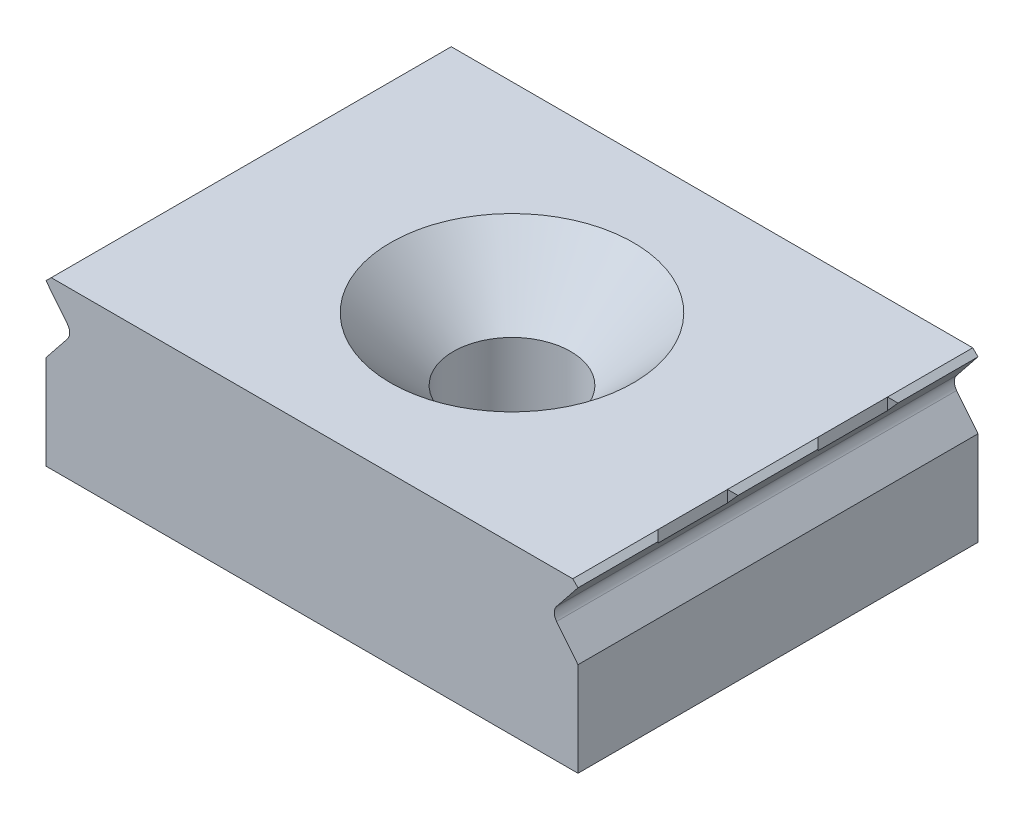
ISO-10303-21;
HEADER;
FILE_DESCRIPTION(('STEP AP214'),'2;1');
FILE_NAME('part.step','',(''),(''),'','','');
FILE_SCHEMA(('AUTOMOTIVE_DESIGN { 1 0 10303 214 1 1 1 1 }'));
ENDSEC;
DATA;
#1=APPLICATION_CONTEXT('core data for automotive mechanical design processes');
#2=APPLICATION_PROTOCOL_DEFINITION('international standard','automotive_design',2000,#1);
#3=PRODUCT_CONTEXT('',#1,'mechanical');
#4=PRODUCT('Part','Part','',(#3));
#5=PRODUCT_RELATED_PRODUCT_CATEGORY('part','',(#4));
#6=PRODUCT_DEFINITION_FORMATION('','',#4);
#7=PRODUCT_DEFINITION_CONTEXT('part definition',#1,'design');
#8=PRODUCT_DEFINITION('design','',#6,#7);
#9=PRODUCT_DEFINITION_SHAPE('','',#8);
#10=(LENGTH_UNIT() NAMED_UNIT(*) SI_UNIT(.MILLI.,.METRE.));
#11=(NAMED_UNIT(*) PLANE_ANGLE_UNIT() SI_UNIT($,.RADIAN.));
#12=(NAMED_UNIT(*) SI_UNIT($,.STERADIAN.) SOLID_ANGLE_UNIT());
#13=UNCERTAINTY_MEASURE_WITH_UNIT(LENGTH_MEASURE(1.E-05),#10,'distance_accuracy_value','');
#14=(GEOMETRIC_REPRESENTATION_CONTEXT(3) GLOBAL_UNCERTAINTY_ASSIGNED_CONTEXT((#13)) GLOBAL_UNIT_ASSIGNED_CONTEXT((#10,
#11,#12)) REPRESENTATION_CONTEXT('',''));
#15=CARTESIAN_POINT('',(0.,0.,0.));
#16=DIRECTION('',(0.,0.,1.));
#17=DIRECTION('',(1.,0.,0.));
#18=AXIS2_PLACEMENT_3D('',#15,#16,#17);
#19=CARTESIAN_POINT('',(12.45,3.96,0.));
#20=DIRECTION('',(0.707106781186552,0.707106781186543,0.));
#21=DIRECTION('',(0.,0.,1.));
#22=AXIS2_PLACEMENT_3D('',#19,#20,#21);
#23=PLANE('',#22);
#24=DIRECTION('',(0.577350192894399,-0.577350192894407,0.57735042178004));
#25=VECTOR('',#24,1.);
#26=CARTESIAN_POINT('',(13.1700001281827,3.23999987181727,-1.43999968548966));
#27=LINE('',#26,#25);
#28=CARTESIAN_POINT('',(12.45,3.96,-2.16000009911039));
#29=VERTEX_POINT('',#28);
#30=CARTESIAN_POINT('',(12.7,3.70999999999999,-1.91));
#31=VERTEX_POINT('',#30);
#32=EDGE_CURVE('E260',#29,#31,#27,.T.);
#33=ORIENTED_EDGE('',*,*,#32,.F.);
#34=DIRECTION('',(0.,0.,-1.));
#35=VECTOR('',#34,1.);
#36=CARTESIAN_POINT('',(12.45,3.96,-9.55));
#37=LINE('',#36,#35);
#38=CARTESIAN_POINT('',(12.45,3.96,2.15999990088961));
#39=VERTEX_POINT('',#38);
#40=EDGE_CURVE('E400',#39,#29,#37,.T.);
#41=ORIENTED_EDGE('',*,*,#40,.F.);
#42=DIRECTION('',(-0.577350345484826,0.577350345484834,0.577350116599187));
#43=VECTOR('',#42,1.);
#44=CARTESIAN_POINT('',(13.1699998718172,3.24000012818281,1.44000031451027));
#45=LINE('',#44,#43);
#46=CARTESIAN_POINT('',(12.7,3.70999999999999,1.91));
#47=VERTEX_POINT('',#46);
#48=EDGE_CURVE('E273',#47,#39,#45,.T.);
#49=ORIENTED_EDGE('',*,*,#48,.F.);
#50=DIRECTION('',(0.,0.,1.));
#51=VECTOR('',#50,1.);
#52=CARTESIAN_POINT('',(12.7,3.71,9.55));
#53=LINE('',#52,#51);
#54=EDGE_CURVE('E413',#31,#47,#53,.T.);
#55=ORIENTED_EDGE('',*,*,#54,.F.);
#56=EDGE_LOOP('',(#33,#41,#49,#55));
#57=FACE_BOUND('',#56,.T.);
#58=ADVANCED_FACE('F39',(#57),#23,.T.);
#59=CARTESIAN_POINT('',(-12.45,3.96,0.));
#60=DIRECTION('',(-0.707106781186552,0.707106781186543,0.));
#61=DIRECTION('',(0.,0.,-1.));
#62=AXIS2_PLACEMENT_3D('',#59,#60,#61);
#63=PLANE('',#62);
#64=DIRECTION('',(0.577350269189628,0.577350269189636,-0.577350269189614));
#65=VECTOR('',#64,1.);
#66=CARTESIAN_POINT('',(-13.17,3.24000000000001,-1.44000000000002));
#67=LINE('',#66,#65);
#68=CARTESIAN_POINT('',(-12.7,3.71000000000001,-1.91));
#69=VERTEX_POINT('',#68);
#70=CARTESIAN_POINT('',(-12.45,3.96,-2.15999999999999));
#71=VERTEX_POINT('',#70);
#72=EDGE_CURVE('E201',#69,#71,#67,.T.);
#73=ORIENTED_EDGE('',*,*,#72,.F.);
#74=DIRECTION('',(0.,0.,-1.));
#75=VECTOR('',#74,1.);
#76=CARTESIAN_POINT('',(-12.7,3.71,-9.55));
#77=LINE('',#76,#75);
#78=CARTESIAN_POINT('',(-12.7,3.71000000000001,1.91000000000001));
#79=VERTEX_POINT('',#78);
#80=EDGE_CURVE('E426',#79,#69,#77,.T.);
#81=ORIENTED_EDGE('',*,*,#80,.F.);
#82=DIRECTION('',(-0.57735026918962,-0.577350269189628,-0.577350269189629));
#83=VECTOR('',#82,1.);
#84=CARTESIAN_POINT('',(-13.17,3.23999999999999,1.44));
#85=LINE('',#84,#83);
#86=CARTESIAN_POINT('',(-12.45,3.96,2.16000000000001));
#87=VERTEX_POINT('',#86);
#88=EDGE_CURVE('E226',#87,#79,#85,.T.);
#89=ORIENTED_EDGE('',*,*,#88,.F.);
#90=DIRECTION('',(0.,0.,1.));
#91=VECTOR('',#90,1.);
#92=CARTESIAN_POINT('',(-12.45,3.96,9.55));
#93=LINE('',#92,#91);
#94=EDGE_CURVE('E224',#71,#87,#93,.T.);
#95=ORIENTED_EDGE('',*,*,#94,.F.);
#96=EDGE_LOOP('',(#73,#81,#89,#95));
#97=FACE_BOUND('',#96,.T.);
#98=ADVANCED_FACE('F225',(#97),#63,.T.);
#99=DIRECTION('',(0.577350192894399,-0.577350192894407,0.57735042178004));
#100=VECTOR('',#99,1.);
#101=CARTESIAN_POINT('',(10.6233331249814,5.78666687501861,3.65333230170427));
#102=LINE('',#101,#100);
#103=CARTESIAN_POINT('',(12.45,3.96,5.47999990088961));
#104=VERTEX_POINT('',#103);
#105=CARTESIAN_POINT('',(12.7,3.70999999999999,5.73));
#106=VERTEX_POINT('',#105);
#107=EDGE_CURVE('E288',#104,#106,#102,.T.);
#108=ORIENTED_EDGE('',*,*,#107,.F.);
#109=CARTESIAN_POINT('',(12.45,3.96,9.55));
#110=VERTEX_POINT('',#109);
#111=EDGE_CURVE('E395',#110,#104,#37,.T.);
#112=ORIENTED_EDGE('',*,*,#111,.F.);
#113=DIRECTION('',(-0.707106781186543,0.707106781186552,0.));
#114=VECTOR('',#113,1.);
#115=CARTESIAN_POINT('',(12.45,3.96,9.55));
#116=LINE('',#115,#114);
#117=CARTESIAN_POINT('',(12.7,3.71,9.55));
#118=VERTEX_POINT('',#117);
#119=EDGE_CURVE('E417',#118,#110,#116,.T.);
#120=ORIENTED_EDGE('',*,*,#119,.F.);
#121=EDGE_CURVE('E407',#106,#118,#53,.T.);
#122=ORIENTED_EDGE('',*,*,#121,.F.);
#123=EDGE_LOOP('',(#108,#112,#120,#122));
#124=FACE_BOUND('',#123,.T.);
#125=ADVANCED_FACE('F482',(#124),#23,.T.);
#126=DIRECTION('',(0.577350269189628,0.577350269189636,-0.577350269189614));
#127=VECTOR('',#126,1.);
#128=CARTESIAN_POINT('',(-10.6233333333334,5.78666666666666,3.65333333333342));
#129=LINE('',#128,#127);
#130=CARTESIAN_POINT('',(-12.7,3.71000000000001,5.73));
#131=VERTEX_POINT('',#130);
#132=CARTESIAN_POINT('',(-12.45,3.96,5.48000000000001));
#133=VERTEX_POINT('',#132);
#134=EDGE_CURVE('E293',#131,#133,#129,.T.);
#135=ORIENTED_EDGE('',*,*,#134,.F.);
#136=CARTESIAN_POINT('',(-12.7,3.71,9.55));
#137=VERTEX_POINT('',#136);
#138=EDGE_CURVE('E421',#137,#131,#77,.T.);
#139=ORIENTED_EDGE('',*,*,#138,.F.);
#140=DIRECTION('',(-0.707106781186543,-0.707106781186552,0.));
#141=VECTOR('',#140,1.);
#142=CARTESIAN_POINT('',(-12.45,3.96,9.55));
#143=LINE('',#142,#141);
#144=CARTESIAN_POINT('',(-12.45,3.96,9.55));
#145=VERTEX_POINT('',#144);
#146=EDGE_CURVE('E412',#145,#137,#143,.T.);
#147=ORIENTED_EDGE('',*,*,#146,.F.);
#148=EDGE_CURVE('E232',#133,#145,#93,.T.);
#149=ORIENTED_EDGE('',*,*,#148,.F.);
#150=EDGE_LOOP('',(#135,#139,#147,#149));
#151=FACE_BOUND('',#150,.T.);
#152=ADVANCED_FACE('F487',(#151),#63,.T.);
#153=CARTESIAN_POINT('',(12.7,3.96,9.55));
#154=DIRECTION('',(0.,0.,-1.));
#155=DIRECTION('',(-1.,0.,0.));
#156=AXIS2_PLACEMENT_3D('',#153,#154,#155);
#157=PLANE('',#156);
#158=DIRECTION('',(-0.624095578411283,0.781348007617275,0.));
#159=VECTOR('',#158,1.);
#160=CARTESIAN_POINT('',(11.6792457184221,1.80795221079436,9.55));
#161=LINE('',#160,#159);
#162=CARTESIAN_POINT('',(12.7,0.530000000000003,9.55));
#163=VERTEX_POINT('',#162);
#164=CARTESIAN_POINT('',(11.6792457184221,1.80795221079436,9.55));
#165=VERTEX_POINT('',#164);
#166=EDGE_CURVE('E314',#163,#165,#161,.T.);
#167=ORIENTED_EDGE('',*,*,#166,.T.);
#168=CARTESIAN_POINT('',(12.0699197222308,2.12,9.55));
#169=DIRECTION('',(0.,0.,-1.));
#170=DIRECTION('',(1.,0.,0.));
#171=AXIS2_PLACEMENT_3D('',#168,#169,#170);
#172=CIRCLE('',#171,0.5);
#173=CARTESIAN_POINT('',(11.6792457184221,2.43204778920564,9.55));
#174=VERTEX_POINT('',#173);
#175=EDGE_CURVE('E310',#165,#174,#172,.T.);
#176=ORIENTED_EDGE('',*,*,#175,.T.);
#177=DIRECTION('',(0.624095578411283,0.781348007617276,0.));
#178=VECTOR('',#177,1.);
#179=CARTESIAN_POINT('',(12.7,3.71,9.55));
#180=LINE('',#179,#178);
#181=EDGE_CURVE('E296',#174,#118,#180,.T.);
#182=ORIENTED_EDGE('',*,*,#181,.T.);
#183=ORIENTED_EDGE('',*,*,#119,.T.);
#184=DIRECTION('',(1.,0.,0.));
#185=VECTOR('',#184,1.);
#186=CARTESIAN_POINT('',(12.7,3.96,9.55));
#187=LINE('',#186,#185);
#188=EDGE_CURVE('E360',#145,#110,#187,.T.);
#189=ORIENTED_EDGE('',*,*,#188,.F.);
#190=ORIENTED_EDGE('',*,*,#146,.T.);
#191=DIRECTION('',(-0.624095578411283,0.781348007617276,0.));
#192=VECTOR('',#191,1.);
#193=CARTESIAN_POINT('',(-12.7,3.71,9.55));
#194=LINE('',#193,#192);
#195=CARTESIAN_POINT('',(-11.6792457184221,2.43204778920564,9.55));
#196=VERTEX_POINT('',#195);
#197=EDGE_CURVE('E306',#196,#137,#194,.T.);
#198=ORIENTED_EDGE('',*,*,#197,.F.);
#199=CARTESIAN_POINT('',(-12.0699197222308,2.12,9.55));
#200=DIRECTION('',(0.,0.,1.));
#201=DIRECTION('',(-1.,0.,0.));
#202=AXIS2_PLACEMENT_3D('',#199,#200,#201);
#203=CIRCLE('',#202,0.5);
#204=CARTESIAN_POINT('',(-11.6792457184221,1.80795221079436,9.55));
#205=VERTEX_POINT('',#204);
#206=EDGE_CURVE('E348',#205,#196,#203,.T.);
#207=ORIENTED_EDGE('',*,*,#206,.F.);
#208=DIRECTION('',(0.624095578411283,0.781348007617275,0.));
#209=VECTOR('',#208,1.);
#210=CARTESIAN_POINT('',(-11.6792457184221,1.80795221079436,9.55));
#211=LINE('',#210,#209);
#212=CARTESIAN_POINT('',(-12.7,0.530000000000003,9.55));
#213=VERTEX_POINT('',#212);
#214=EDGE_CURVE('E344',#213,#205,#211,.T.);
#215=ORIENTED_EDGE('',*,*,#214,.F.);
#216=DIRECTION('',(0.,-1.,0.));
#217=VECTOR('',#216,1.);
#218=CARTESIAN_POINT('',(-12.7,3.96,9.55));
#219=LINE('',#218,#217);
#220=CARTESIAN_POINT('',(-12.7,-3.96,9.55));
#221=VERTEX_POINT('',#220);
#222=EDGE_CURVE('E390',#213,#221,#219,.T.);
#223=ORIENTED_EDGE('',*,*,#222,.T.);
#224=DIRECTION('',(1.,0.,0.));
#225=VECTOR('',#224,1.);
#226=CARTESIAN_POINT('',(12.7,-3.96,9.55));
#227=LINE('',#226,#225);
#228=CARTESIAN_POINT('',(12.7,-3.96,9.55));
#229=VERTEX_POINT('',#228);
#230=EDGE_CURVE('E371',#221,#229,#227,.T.);
#231=ORIENTED_EDGE('',*,*,#230,.T.);
#232=DIRECTION('',(0.,-1.,0.));
#233=VECTOR('',#232,1.);
#234=CARTESIAN_POINT('',(12.7,3.96,9.55));
#235=LINE('',#234,#233);
#236=EDGE_CURVE('E387',#163,#229,#235,.T.);
#237=ORIENTED_EDGE('',*,*,#236,.F.);
#238=EDGE_LOOP('',(#167,#176,#182,#183,#189,#190,#198,#207,#215,#223,#231,#237));
#239=FACE_BOUND('',#238,.T.);
#240=ADVANCED_FACE('F548',(#239),#157,.F.);
#241=CARTESIAN_POINT('',(12.7,3.96,9.55));
#242=DIRECTION('',(-1.,0.,0.));
#243=DIRECTION('',(0.,0.,1.));
#244=AXIS2_PLACEMENT_3D('',#241,#242,#243);
#245=PLANE('',#244);
#246=DIRECTION('',(0.,0.,1.));
#247=VECTOR('',#246,1.);
#248=CARTESIAN_POINT('',(12.7,0.530000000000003,-12.9248305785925));
#249=LINE('',#248,#247);
#250=CARTESIAN_POINT('',(12.7,0.530000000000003,-9.55));
#251=VERTEX_POINT('',#250);
#252=EDGE_CURVE('E319',#251,#163,#249,.T.);
#253=ORIENTED_EDGE('',*,*,#252,.T.);
#254=ORIENTED_EDGE('',*,*,#236,.T.);
#255=DIRECTION('',(0.,0.,-1.));
#256=VECTOR('',#255,1.);
#257=CARTESIAN_POINT('',(12.7,-3.96,9.55));
#258=LINE('',#257,#256);
#259=CARTESIAN_POINT('',(12.7,-3.96,-9.55));
#260=VERTEX_POINT('',#259);
#261=EDGE_CURVE('E375',#229,#260,#258,.T.);
#262=ORIENTED_EDGE('',*,*,#261,.T.);
#263=DIRECTION('',(0.,-1.,0.));
#264=VECTOR('',#263,1.);
#265=CARTESIAN_POINT('',(12.7,3.96,-9.55));
#266=LINE('',#265,#264);
#267=EDGE_CURVE('E384',#251,#260,#266,.T.);
#268=ORIENTED_EDGE('',*,*,#267,.F.);
#269=EDGE_LOOP('',(#253,#254,#262,#268));
#270=FACE_BOUND('',#269,.T.);
#271=ADVANCED_FACE('F545',(#270),#245,.F.);
#272=CARTESIAN_POINT('',(12.7,3.96,-9.55));
#273=DIRECTION('',(0.,0.,1.));
#274=DIRECTION('',(1.,0.,0.));
#275=AXIS2_PLACEMENT_3D('',#272,#273,#274);
#276=PLANE('',#275);
#277=DIRECTION('',(0.624095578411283,-0.781348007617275,0.));
#278=VECTOR('',#277,1.);
#279=CARTESIAN_POINT('',(11.6792457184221,1.80795221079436,-9.55));
#280=LINE('',#279,#278);
#281=CARTESIAN_POINT('',(11.6792457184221,1.80795221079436,-9.55));
#282=VERTEX_POINT('',#281);
#283=EDGE_CURVE('E297',#282,#251,#280,.T.);
#284=ORIENTED_EDGE('',*,*,#283,.T.);
#285=ORIENTED_EDGE('',*,*,#267,.T.);
#286=DIRECTION('',(-1.,0.,0.));
#287=VECTOR('',#286,1.);
#288=CARTESIAN_POINT('',(12.7,-3.96,-9.55));
#289=LINE('',#288,#287);
#290=CARTESIAN_POINT('',(-12.7,-3.96,-9.55));
#291=VERTEX_POINT('',#290);
#292=EDGE_CURVE('E364',#260,#291,#289,.T.);
#293=ORIENTED_EDGE('',*,*,#292,.T.);
#294=DIRECTION('',(0.,-1.,0.));
#295=VECTOR('',#294,1.);
#296=CARTESIAN_POINT('',(-12.7,3.96,-9.55));
#297=LINE('',#296,#295);
#298=CARTESIAN_POINT('',(-12.7,0.530000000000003,-9.55));
#299=VERTEX_POINT('',#298);
#300=EDGE_CURVE('E367',#299,#291,#297,.T.);
#301=ORIENTED_EDGE('',*,*,#300,.F.);
#302=DIRECTION('',(-0.624095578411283,-0.781348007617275,0.));
#303=VECTOR('',#302,1.);
#304=CARTESIAN_POINT('',(-11.6792457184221,1.80795221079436,-9.55));
#305=LINE('',#304,#303);
#306=CARTESIAN_POINT('',(-11.6792457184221,1.80795221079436,-9.55));
#307=VERTEX_POINT('',#306);
#308=EDGE_CURVE('E331',#307,#299,#305,.T.);
#309=ORIENTED_EDGE('',*,*,#308,.F.);
#310=CARTESIAN_POINT('',(-12.0699197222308,2.12,-9.55));
#311=DIRECTION('',(0.,0.,1.));
#312=DIRECTION('',(1.,0.,0.));
#313=AXIS2_PLACEMENT_3D('',#310,#311,#312);
#314=CIRCLE('',#313,0.5);
#315=CARTESIAN_POINT('',(-11.6792457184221,2.43204778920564,-9.55));
#316=VERTEX_POINT('',#315);
#317=EDGE_CURVE('E334',#316,#307,#314,.F.);
#318=ORIENTED_EDGE('',*,*,#317,.F.);
#319=DIRECTION('',(0.624095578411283,-0.781348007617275,0.));
#320=VECTOR('',#319,1.);
#321=CARTESIAN_POINT('',(-12.7,3.71,-9.55));
#322=LINE('',#321,#320);
#323=CARTESIAN_POINT('',(-12.7,3.71,-9.55));
#324=VERTEX_POINT('',#323);
#325=EDGE_CURVE('E338',#324,#316,#322,.T.);
#326=ORIENTED_EDGE('',*,*,#325,.F.);
#327=DIRECTION('',(0.707106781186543,0.707106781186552,0.));
#328=VECTOR('',#327,1.);
#329=CARTESIAN_POINT('',(-12.45,3.96,-9.55));
#330=LINE('',#329,#328);
#331=CARTESIAN_POINT('',(-12.45,3.96,-9.55));
#332=VERTEX_POINT('',#331);
#333=EDGE_CURVE('E399',#324,#332,#330,.T.);
#334=ORIENTED_EDGE('',*,*,#333,.T.);
#335=DIRECTION('',(-1.,0.,0.));
#336=VECTOR('',#335,1.);
#337=CARTESIAN_POINT('',(12.7,3.96,-9.55));
#338=LINE('',#337,#336);
#339=CARTESIAN_POINT('',(12.45,3.96,-9.55));
#340=VERTEX_POINT('',#339);
#341=EDGE_CURVE('E363',#340,#332,#338,.T.);
#342=ORIENTED_EDGE('',*,*,#341,.F.);
#343=DIRECTION('',(0.707106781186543,-0.707106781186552,0.));
#344=VECTOR('',#343,1.);
#345=CARTESIAN_POINT('',(12.45,3.96,-9.55));
#346=LINE('',#345,#344);
#347=CARTESIAN_POINT('',(12.7,3.71,-9.55));
#348=VERTEX_POINT('',#347);
#349=EDGE_CURVE('E403',#340,#348,#346,.T.);
#350=ORIENTED_EDGE('',*,*,#349,.T.);
#351=DIRECTION('',(-0.624095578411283,-0.781348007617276,0.));
#352=VECTOR('',#351,1.);
#353=CARTESIAN_POINT('',(12.7,3.71,-9.55));
#354=LINE('',#353,#352);
#355=CARTESIAN_POINT('',(11.6792457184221,2.43204778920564,-9.55));
#356=VERTEX_POINT('',#355);
#357=EDGE_CURVE('E301',#348,#356,#354,.T.);
#358=ORIENTED_EDGE('',*,*,#357,.T.);
#359=CARTESIAN_POINT('',(12.0699197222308,2.12,-9.55));
#360=DIRECTION('',(0.,0.,1.));
#361=DIRECTION('',(1.,0.,0.));
#362=AXIS2_PLACEMENT_3D('',#359,#360,#361);
#363=CIRCLE('',#362,0.5);
#364=EDGE_CURVE('E302',#356,#282,#363,.T.);
#365=ORIENTED_EDGE('',*,*,#364,.T.);
#366=EDGE_LOOP('',(#284,#285,#293,#301,#309,#318,#326,#334,#342,#350,#358,#365));
#367=FACE_BOUND('',#366,.T.);
#368=ADVANCED_FACE('F518',(#367),#276,.F.);
#369=CARTESIAN_POINT('',(-12.7,3.96,9.55));
#370=DIRECTION('',(1.,0.,0.));
#371=DIRECTION('',(0.,0.,-1.));
#372=AXIS2_PLACEMENT_3D('',#369,#370,#371);
#373=PLANE('',#372);
#374=ORIENTED_EDGE('',*,*,#222,.F.);
#375=DIRECTION('',(0.,0.,1.));
#376=VECTOR('',#375,1.);
#377=CARTESIAN_POINT('',(-12.7,0.530000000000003,-12.9248305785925));
#378=LINE('',#377,#376);
#379=EDGE_CURVE('E352',#299,#213,#378,.T.);
#380=ORIENTED_EDGE('',*,*,#379,.F.);
#381=ORIENTED_EDGE('',*,*,#300,.T.);
#382=DIRECTION('',(0.,0.,1.));
#383=VECTOR('',#382,1.);
#384=CARTESIAN_POINT('',(-12.7,-3.96,9.55));
#385=LINE('',#384,#383);
#386=EDGE_CURVE('E341',#291,#221,#385,.T.);
#387=ORIENTED_EDGE('',*,*,#386,.T.);
#388=EDGE_LOOP('',(#374,#380,#381,#387));
#389=FACE_BOUND('',#388,.T.);
#390=ADVANCED_FACE('F539',(#389),#373,.F.);
#391=CARTESIAN_POINT('',(0.,3.96,0.));
#392=DIRECTION('',(0.,1.,0.));
#393=DIRECTION('',(0.,0.,1.));
#394=AXIS2_PLACEMENT_3D('',#391,#392,#393);
#395=PLANE('',#394);
#396=CARTESIAN_POINT('',(0.,3.96,0.));
#397=DIRECTION('',(0.,1.,0.));
#398=DIRECTION('',(0.,0.,1.));
#399=AXIS2_PLACEMENT_3D('',#396,#397,#398);
#400=CIRCLE('',#399,5.80000000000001);
#401=CARTESIAN_POINT('',(0.,3.96,5.80000000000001));
#402=VERTEX_POINT('',#401);
#403=EDGE_CURVE('E11',#402,#402,#400,.F.);
#404=ORIENTED_EDGE('',*,*,#403,.T.);
#405=EDGE_LOOP('',(#404));
#406=FACE_BOUND('',#405,.T.);
#407=ORIENTED_EDGE('',*,*,#188,.T.);
#408=ORIENTED_EDGE('',*,*,#111,.T.);
#409=DIRECTION('',(0.,0.,1.));
#410=VECTOR('',#409,1.);
#411=CARTESIAN_POINT('',(12.45,3.96,5.47999990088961));
#412=LINE('',#411,#410);
#413=EDGE_CURVE('E212',#39,#104,#412,.T.);
#414=ORIENTED_EDGE('',*,*,#413,.F.);
#415=ORIENTED_EDGE('',*,*,#40,.T.);
#416=DIRECTION('',(0.,0.,1.));
#417=VECTOR('',#416,1.);
#418=CARTESIAN_POINT('',(12.45,3.96,-2.16000009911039));
#419=LINE('',#418,#417);
#420=CARTESIAN_POINT('',(12.45,3.96,-5.48000009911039));
#421=VERTEX_POINT('',#420);
#422=EDGE_CURVE('E252',#421,#29,#419,.T.);
#423=ORIENTED_EDGE('',*,*,#422,.F.);
#424=EDGE_CURVE('E394',#421,#340,#37,.T.);
#425=ORIENTED_EDGE('',*,*,#424,.T.);
#426=ORIENTED_EDGE('',*,*,#341,.T.);
#427=CARTESIAN_POINT('',(-12.45,3.96,-5.47999999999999));
#428=VERTEX_POINT('',#427);
#429=EDGE_CURVE('E231',#332,#428,#93,.T.);
#430=ORIENTED_EDGE('',*,*,#429,.T.);
#431=DIRECTION('',(0.,0.,-1.));
#432=VECTOR('',#431,1.);
#433=CARTESIAN_POINT('',(-12.45,3.96,-5.47999999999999));
#434=LINE('',#433,#432);
#435=EDGE_CURVE('E217',#71,#428,#434,.T.);
#436=ORIENTED_EDGE('',*,*,#435,.F.);
#437=ORIENTED_EDGE('',*,*,#94,.T.);
#438=DIRECTION('',(0.,0.,-1.));
#439=VECTOR('',#438,1.);
#440=CARTESIAN_POINT('',(-12.45,3.96,2.16000000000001));
#441=LINE('',#440,#439);
#442=EDGE_CURVE('E264',#133,#87,#441,.T.);
#443=ORIENTED_EDGE('',*,*,#442,.F.);
#444=ORIENTED_EDGE('',*,*,#148,.T.);
#445=EDGE_LOOP('',(#407,#408,#414,#415,#423,#425,#426,#430,#436,#437,#443,#444));
#446=FACE_BOUND('',#445,.T.);
#447=ADVANCED_FACE('F236',(#406,#446),#395,.T.);
#448=CARTESIAN_POINT('',(0.,-3.96,0.));
#449=DIRECTION('',(0.,1.,0.));
#450=DIRECTION('',(0.,0.,1.));
#451=AXIS2_PLACEMENT_3D('',#448,#449,#450);
#452=PLANE('',#451);
#453=CARTESIAN_POINT('',(0.,-3.96,0.));
#454=DIRECTION('',(0.,1.,0.));
#455=DIRECTION('',(0.,0.,1.));
#456=AXIS2_PLACEMENT_3D('',#453,#454,#455);
#457=CIRCLE('',#456,2.8);
#458=CARTESIAN_POINT('',(0.,-3.96,2.8));
#459=VERTEX_POINT('',#458);
#460=EDGE_CURVE('E248',#459,#459,#457,.F.);
#461=ORIENTED_EDGE('',*,*,#460,.F.);
#462=EDGE_LOOP('',(#461));
#463=FACE_BOUND('',#462,.T.);
#464=ORIENTED_EDGE('',*,*,#386,.F.);
#465=ORIENTED_EDGE('',*,*,#292,.F.);
#466=ORIENTED_EDGE('',*,*,#261,.F.);
#467=ORIENTED_EDGE('',*,*,#230,.F.);
#468=EDGE_LOOP('',(#464,#465,#466,#467));
#469=FACE_BOUND('',#468,.T.);
#470=ADVANCED_FACE('F494',(#463,#469),#452,.F.);
#471=DIRECTION('',(-0.577350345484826,0.577350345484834,0.577350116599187));
#472=VECTOR('',#471,1.);
#473=CARTESIAN_POINT('',(10.6233335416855,5.78666645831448,-3.65333436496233));
#474=LINE('',#473,#472);
#475=CARTESIAN_POINT('',(12.7,3.70999999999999,-5.73));
#476=VERTEX_POINT('',#475);
#477=EDGE_CURVE('E250',#476,#421,#474,.T.);
#478=ORIENTED_EDGE('',*,*,#477,.F.);
#479=EDGE_CURVE('E408',#348,#476,#53,.T.);
#480=ORIENTED_EDGE('',*,*,#479,.F.);
#481=ORIENTED_EDGE('',*,*,#349,.F.);
#482=ORIENTED_EDGE('',*,*,#424,.F.);
#483=EDGE_LOOP('',(#478,#480,#481,#482));
#484=FACE_BOUND('',#483,.T.);
#485=ADVANCED_FACE('F483',(#484),#23,.T.);
#486=DIRECTION('',(-0.57735026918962,-0.577350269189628,-0.577350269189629));
#487=VECTOR('',#486,1.);
#488=CARTESIAN_POINT('',(-10.6233333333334,5.78666666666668,-3.65333333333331));
#489=LINE('',#488,#487);
#490=CARTESIAN_POINT('',(-12.7,3.71000000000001,-5.72999999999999));
#491=VERTEX_POINT('',#490);
#492=EDGE_CURVE('E213',#428,#491,#489,.T.);
#493=ORIENTED_EDGE('',*,*,#492,.F.);
#494=ORIENTED_EDGE('',*,*,#429,.F.);
#495=ORIENTED_EDGE('',*,*,#333,.F.);
#496=EDGE_CURVE('E420',#491,#324,#77,.T.);
#497=ORIENTED_EDGE('',*,*,#496,.F.);
#498=EDGE_LOOP('',(#493,#494,#495,#497));
#499=FACE_BOUND('',#498,.T.);
#500=ADVANCED_FACE('F488',(#499),#63,.T.);
#501=CARTESIAN_POINT('',(-12.7,3.71,-12.9248305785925));
#502=DIRECTION('',(0.781348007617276,0.624095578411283,0.));
#503=DIRECTION('',(-0.624095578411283,0.781348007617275,0.));
#504=AXIS2_PLACEMENT_3D('',#501,#502,#503);
#505=PLANE('',#504);
#506=ORIENTED_EDGE('',*,*,#80,.T.);
#507=DIRECTION('',(0.529447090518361,-0.662851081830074,-0.529447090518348));
#508=VECTOR('',#507,1.);
#509=CARTESIAN_POINT('',(-9.61238633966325,-0.155595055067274,-4.99761366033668));
#510=LINE('',#509,#508);
#511=CARTESIAN_POINT('',(-12.45,3.39700787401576,-2.15999999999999));
#512=VERTEX_POINT('',#511);
#513=EDGE_CURVE('E206',#69,#512,#510,.T.);
#514=ORIENTED_EDGE('',*,*,#513,.T.);
#515=DIRECTION('',(0.,0.,-1.));
#516=VECTOR('',#515,1.);
#517=CARTESIAN_POINT('',(-12.45,3.39700787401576,-12.9248305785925));
#518=LINE('',#517,#516);
#519=CARTESIAN_POINT('',(-12.45,3.39700787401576,-5.47999999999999));
#520=VERTEX_POINT('',#519);
#521=EDGE_CURVE('E220',#512,#520,#518,.T.);
#522=ORIENTED_EDGE('',*,*,#521,.T.);
#523=DIRECTION('',(-0.529447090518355,0.662851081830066,-0.529447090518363));
#524=VECTOR('',#523,1.);
#525=CARTESIAN_POINT('',(-14.7168133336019,6.23498677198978,-7.74681333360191));
#526=LINE('',#525,#524);
#527=EDGE_CURVE('E460',#520,#491,#526,.T.);
#528=ORIENTED_EDGE('',*,*,#527,.T.);
#529=ORIENTED_EDGE('',*,*,#496,.T.);
#530=ORIENTED_EDGE('',*,*,#325,.T.);
#531=DIRECTION('',(0.,0.,1.));
#532=VECTOR('',#531,1.);
#533=CARTESIAN_POINT('',(-11.6792457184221,2.43204778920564,-12.9248305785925));
#534=LINE('',#533,#532);
#535=EDGE_CURVE('E335',#316,#196,#534,.T.);
#536=ORIENTED_EDGE('',*,*,#535,.T.);
#537=ORIENTED_EDGE('',*,*,#197,.T.);
#538=ORIENTED_EDGE('',*,*,#138,.T.);
#539=DIRECTION('',(0.529447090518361,-0.662851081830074,-0.529447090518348));
#540=VECTOR('',#539,1.);
#541=CARTESIAN_POINT('',(-7.47078568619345,-2.83681162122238,0.500785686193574));
#542=LINE('',#541,#540);
#543=CARTESIAN_POINT('',(-12.45,3.39700787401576,5.48000000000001));
#544=VERTEX_POINT('',#543);
#545=EDGE_CURVE('E445',#131,#544,#542,.T.);
#546=ORIENTED_EDGE('',*,*,#545,.T.);
#547=DIRECTION('',(0.,0.,-1.));
#548=VECTOR('',#547,1.);
#549=CARTESIAN_POINT('',(-12.45,3.39700787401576,-12.9248305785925));
#550=LINE('',#549,#548);
#551=CARTESIAN_POINT('',(-12.45,3.39700787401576,2.16000000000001));
#552=VERTEX_POINT('',#551);
#553=EDGE_CURVE('E437',#544,#552,#550,.T.);
#554=ORIENTED_EDGE('',*,*,#553,.T.);
#555=DIRECTION('',(-0.529447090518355,0.662851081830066,-0.529447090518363));
#556=VECTOR('',#555,1.);
#557=CARTESIAN_POINT('',(-16.8584139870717,8.91620333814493,-2.24841398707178));
#558=LINE('',#557,#556);
#559=EDGE_CURVE('E441',#552,#79,#558,.T.);
#560=ORIENTED_EDGE('',*,*,#559,.T.);
#561=EDGE_LOOP('',(#506,#514,#522,#528,#529,#530,#536,#537,#538,#546,#554,#560));
#562=FACE_BOUND('',#561,.T.);
#563=ADVANCED_FACE('F500',(#562),#505,.F.);
#564=CARTESIAN_POINT('',(-12.0699197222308,2.12,-12.9248305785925));
#565=DIRECTION('',(0.,0.,1.));
#566=DIRECTION('',(1.,0.,0.));
#567=AXIS2_PLACEMENT_3D('',#564,#565,#566);
#568=CYLINDRICAL_SURFACE('',#567,0.5);
#569=ORIENTED_EDGE('',*,*,#317,.T.);
#570=DIRECTION('',(0.,0.,1.));
#571=VECTOR('',#570,1.);
#572=CARTESIAN_POINT('',(-11.6792457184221,1.80795221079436,-12.9248305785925));
#573=LINE('',#572,#571);
#574=EDGE_CURVE('E355',#307,#205,#573,.T.);
#575=ORIENTED_EDGE('',*,*,#574,.T.);
#576=ORIENTED_EDGE('',*,*,#206,.T.);
#577=ORIENTED_EDGE('',*,*,#535,.F.);
#578=EDGE_LOOP('',(#569,#575,#576,#577));
#579=FACE_BOUND('',#578,.T.);
#580=ADVANCED_FACE('F558',(#579),#568,.F.);
#581=CARTESIAN_POINT('',(-11.6792457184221,1.80795221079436,-12.9248305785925));
#582=DIRECTION('',(0.781348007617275,-0.624095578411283,0.));
#583=DIRECTION('',(0.624095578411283,0.781348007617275,0.));
#584=AXIS2_PLACEMENT_3D('',#581,#582,#583);
#585=PLANE('',#584);
#586=ORIENTED_EDGE('',*,*,#308,.T.);
#587=ORIENTED_EDGE('',*,*,#379,.T.);
#588=ORIENTED_EDGE('',*,*,#214,.T.);
#589=ORIENTED_EDGE('',*,*,#574,.F.);
#590=EDGE_LOOP('',(#586,#587,#588,#589));
#591=FACE_BOUND('',#590,.T.);
#592=ADVANCED_FACE('F554',(#591),#585,.F.);
#593=CARTESIAN_POINT('',(12.0699197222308,2.12,-12.9248305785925));
#594=DIRECTION('',(0.,0.,1.));
#595=DIRECTION('',(1.,0.,0.));
#596=AXIS2_PLACEMENT_3D('',#593,#594,#595);
#597=CYLINDRICAL_SURFACE('',#596,0.5);
#598=DIRECTION('',(0.,0.,1.));
#599=VECTOR('',#598,1.);
#600=CARTESIAN_POINT('',(11.6792457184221,2.43204778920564,-12.9248305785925));
#601=LINE('',#600,#599);
#602=EDGE_CURVE('E318',#356,#174,#601,.T.);
#603=ORIENTED_EDGE('',*,*,#602,.T.);
#604=ORIENTED_EDGE('',*,*,#175,.F.);
#605=DIRECTION('',(0.,0.,1.));
#606=VECTOR('',#605,1.);
#607=CARTESIAN_POINT('',(11.6792457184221,1.80795221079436,-12.9248305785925));
#608=LINE('',#607,#606);
#609=EDGE_CURVE('E323',#282,#165,#608,.T.);
#610=ORIENTED_EDGE('',*,*,#609,.F.);
#611=ORIENTED_EDGE('',*,*,#364,.F.);
#612=EDGE_LOOP('',(#603,#604,#610,#611));
#613=FACE_BOUND('',#612,.T.);
#614=ADVANCED_FACE('F600',(#613),#597,.F.);
#615=CARTESIAN_POINT('',(11.6792457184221,1.80795221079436,-12.9248305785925));
#616=DIRECTION('',(0.781348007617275,0.624095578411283,0.));
#617=DIRECTION('',(-0.624095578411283,0.781348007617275,0.));
#618=AXIS2_PLACEMENT_3D('',#615,#616,#617);
#619=PLANE('',#618);
#620=ORIENTED_EDGE('',*,*,#609,.T.);
#621=ORIENTED_EDGE('',*,*,#166,.F.);
#622=ORIENTED_EDGE('',*,*,#252,.F.);
#623=ORIENTED_EDGE('',*,*,#283,.F.);
#624=EDGE_LOOP('',(#620,#621,#622,#623));
#625=FACE_BOUND('',#624,.T.);
#626=ADVANCED_FACE('F597',(#625),#619,.T.);
#627=CARTESIAN_POINT('',(12.7,3.71,-12.9248305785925));
#628=DIRECTION('',(0.781348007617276,-0.624095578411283,0.));
#629=DIRECTION('',(0.624095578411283,0.781348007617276,0.));
#630=AXIS2_PLACEMENT_3D('',#627,#628,#629);
#631=PLANE('',#630);
#632=DIRECTION('',(-0.529447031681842,-0.662851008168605,-0.529447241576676));
#633=VECTOR('',#632,1.);
#634=CARTESIAN_POINT('',(9.61238580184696,-0.155595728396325,-4.99761542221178));
#635=LINE('',#634,#633);
#636=CARTESIAN_POINT('',(12.45,3.39700787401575,-2.16000009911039));
#637=VERTEX_POINT('',#636);
#638=EDGE_CURVE('E455',#31,#637,#635,.T.);
#639=ORIENTED_EDGE('',*,*,#638,.F.);
#640=ORIENTED_EDGE('',*,*,#54,.T.);
#641=DIRECTION('',(0.529447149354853,0.662851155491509,-0.529446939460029));
#642=VECTOR('',#641,1.);
#643=CARTESIAN_POINT('',(16.8584132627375,8.9162024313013,-2.24841161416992));
#644=LINE('',#643,#642);
#645=CARTESIAN_POINT('',(12.45,3.39700787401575,2.15999990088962));
#646=VERTEX_POINT('',#645);
#647=EDGE_CURVE('E425',#646,#47,#644,.T.);
#648=ORIENTED_EDGE('',*,*,#647,.F.);
#649=DIRECTION('',(0.,0.,-1.));
#650=VECTOR('',#649,1.);
#651=CARTESIAN_POINT('',(12.45,3.39700787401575,-12.9248305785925));
#652=LINE('',#651,#650);
#653=CARTESIAN_POINT('',(12.45,3.39700787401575,5.47999990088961));
#654=VERTEX_POINT('',#653);
#655=EDGE_CURVE('E430',#654,#646,#652,.T.);
#656=ORIENTED_EDGE('',*,*,#655,.F.);
#657=DIRECTION('',(-0.529447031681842,-0.662851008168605,-0.529447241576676));
#658=VECTOR('',#657,1.);
#659=CARTESIAN_POINT('',(7.47078477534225,-2.83681276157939,0.50078270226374));
#660=LINE('',#659,#658);
#661=EDGE_CURVE('E434',#106,#654,#660,.T.);
#662=ORIENTED_EDGE('',*,*,#661,.F.);
#663=ORIENTED_EDGE('',*,*,#121,.T.);
#664=ORIENTED_EDGE('',*,*,#181,.F.);
#665=ORIENTED_EDGE('',*,*,#602,.F.);
#666=ORIENTED_EDGE('',*,*,#357,.F.);
#667=ORIENTED_EDGE('',*,*,#479,.T.);
#668=DIRECTION('',(0.529447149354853,0.662851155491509,-0.529446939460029));
#669=VECTOR('',#668,1.);
#670=CARTESIAN_POINT('',(14.7168129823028,6.23498633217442,-7.74681218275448));
#671=LINE('',#670,#669);
#672=CARTESIAN_POINT('',(12.45,3.39700787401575,-5.48000009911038));
#673=VERTEX_POINT('',#672);
#674=EDGE_CURVE('E449',#673,#476,#671,.T.);
#675=ORIENTED_EDGE('',*,*,#674,.F.);
#676=DIRECTION('',(0.,0.,-1.));
#677=VECTOR('',#676,1.);
#678=CARTESIAN_POINT('',(12.45,3.39700787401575,-12.9248305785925));
#679=LINE('',#678,#677);
#680=EDGE_CURVE('E452',#637,#673,#679,.T.);
#681=ORIENTED_EDGE('',*,*,#680,.F.);
#682=EDGE_LOOP('',(#639,#640,#648,#656,#662,#663,#664,#665,#666,#667,#675,#681));
#683=FACE_BOUND('',#682,.T.);
#684=ADVANCED_FACE('F512',(#683),#631,.T.);
#685=CARTESIAN_POINT('',(12.7,2.96,5.73));
#686=DIRECTION('',(-0.707106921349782,0.,0.707106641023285));
#687=DIRECTION('',(0.707106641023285,0.,0.707106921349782));
#688=AXIS2_PLACEMENT_3D('',#685,#686,#687);
#689=PLANE('',#688);
#690=ORIENTED_EDGE('',*,*,#107,.T.);
#691=ORIENTED_EDGE('',*,*,#661,.T.);
#692=DIRECTION('',(0.,1.,0.));
#693=VECTOR('',#692,1.);
#694=CARTESIAN_POINT('',(12.45,2.96,5.47999990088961));
#695=LINE('',#694,#693);
#696=EDGE_CURVE('E269',#654,#104,#695,.T.);
#697=ORIENTED_EDGE('',*,*,#696,.T.);
#698=EDGE_LOOP('',(#690,#691,#697));
#699=FACE_BOUND('',#698,.T.);
#700=ADVANCED_FACE('F586',(#699),#689,.F.);
#701=CARTESIAN_POINT('',(12.45,2.96,5.47999990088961));
#702=DIRECTION('',(-1.,0.,0.));
#703=DIRECTION('',(0.,0.,1.));
#704=AXIS2_PLACEMENT_3D('',#701,#702,#703);
#705=PLANE('',#704);
#706=ORIENTED_EDGE('',*,*,#655,.T.);
#707=DIRECTION('',(0.,1.,0.));
#708=VECTOR('',#707,1.);
#709=CARTESIAN_POINT('',(12.45,2.96,2.15999990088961));
#710=LINE('',#709,#708);
#711=EDGE_CURVE('E280',#646,#39,#710,.T.);
#712=ORIENTED_EDGE('',*,*,#711,.T.);
#713=ORIENTED_EDGE('',*,*,#413,.T.);
#714=ORIENTED_EDGE('',*,*,#696,.F.);
#715=EDGE_LOOP('',(#706,#712,#713,#714));
#716=FACE_BOUND('',#715,.T.);
#717=ADVANCED_FACE('F589',(#716),#705,.F.);
#718=CARTESIAN_POINT('',(12.45,2.96,2.15999990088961));
#719=DIRECTION('',(-0.707106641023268,0.,-0.707106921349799));
#720=DIRECTION('',(-0.707106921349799,0.,0.707106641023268));
#721=AXIS2_PLACEMENT_3D('',#718,#719,#720);
#722=PLANE('',#721);
#723=ORIENTED_EDGE('',*,*,#48,.T.);
#724=ORIENTED_EDGE('',*,*,#711,.F.);
#725=ORIENTED_EDGE('',*,*,#647,.T.);
#726=EDGE_LOOP('',(#723,#724,#725));
#727=FACE_BOUND('',#726,.T.);
#728=ADVANCED_FACE('F580',(#727),#722,.F.);
#729=CARTESIAN_POINT('',(-12.45,2.96,5.48000000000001));
#730=DIRECTION('',(0.707106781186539,0.,0.707106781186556));
#731=DIRECTION('',(0.707106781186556,0.,-0.707106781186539));
#732=AXIS2_PLACEMENT_3D('',#729,#730,#731);
#733=PLANE('',#732);
#734=ORIENTED_EDGE('',*,*,#134,.T.);
#735=DIRECTION('',(0.,1.,0.));
#736=VECTOR('',#735,1.);
#737=CARTESIAN_POINT('',(-12.45,2.96,5.48000000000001));
#738=LINE('',#737,#736);
#739=EDGE_CURVE('E268',#544,#133,#738,.T.);
#740=ORIENTED_EDGE('',*,*,#739,.F.);
#741=ORIENTED_EDGE('',*,*,#545,.F.);
#742=EDGE_LOOP('',(#734,#740,#741));
#743=FACE_BOUND('',#742,.T.);
#744=ADVANCED_FACE('F567',(#743),#733,.F.);
#745=CARTESIAN_POINT('',(-12.7,2.96,1.91000000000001));
#746=DIRECTION('',(0.707106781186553,0.,-0.707106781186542));
#747=DIRECTION('',(-0.707106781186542,0.,-0.707106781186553));
#748=AXIS2_PLACEMENT_3D('',#745,#746,#747);
#749=PLANE('',#748);
#750=ORIENTED_EDGE('',*,*,#88,.T.);
#751=ORIENTED_EDGE('',*,*,#559,.F.);
#752=DIRECTION('',(0.,1.,0.));
#753=VECTOR('',#752,1.);
#754=CARTESIAN_POINT('',(-12.45,2.96,2.16000000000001));
#755=LINE('',#754,#753);
#756=EDGE_CURVE('E270',#552,#87,#755,.T.);
#757=ORIENTED_EDGE('',*,*,#756,.T.);
#758=EDGE_LOOP('',(#750,#751,#757));
#759=FACE_BOUND('',#758,.T.);
#760=ADVANCED_FACE('F571',(#759),#749,.F.);
#761=CARTESIAN_POINT('',(-12.45,2.96,2.16000000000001));
#762=DIRECTION('',(1.,0.,0.));
#763=DIRECTION('',(0.,0.,-1.));
#764=AXIS2_PLACEMENT_3D('',#761,#762,#763);
#765=PLANE('',#764);
#766=ORIENTED_EDGE('',*,*,#739,.T.);
#767=ORIENTED_EDGE('',*,*,#442,.T.);
#768=ORIENTED_EDGE('',*,*,#756,.F.);
#769=ORIENTED_EDGE('',*,*,#553,.F.);
#770=EDGE_LOOP('',(#766,#767,#768,#769));
#771=FACE_BOUND('',#770,.T.);
#772=ADVANCED_FACE('F569',(#771),#765,.F.);
#773=CARTESIAN_POINT('',(12.7,2.96,-1.91));
#774=DIRECTION('',(-0.707106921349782,0.,0.707106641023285));
#775=DIRECTION('',(0.707106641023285,0.,0.707106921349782));
#776=AXIS2_PLACEMENT_3D('',#773,#774,#775);
#777=PLANE('',#776);
#778=ORIENTED_EDGE('',*,*,#32,.T.);
#779=ORIENTED_EDGE('',*,*,#638,.T.);
#780=DIRECTION('',(0.,1.,0.));
#781=VECTOR('',#780,1.);
#782=CARTESIAN_POINT('',(12.45,2.96,-2.16000009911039));
#783=LINE('',#782,#781);
#784=EDGE_CURVE('E240',#637,#29,#783,.T.);
#785=ORIENTED_EDGE('',*,*,#784,.T.);
#786=EDGE_LOOP('',(#778,#779,#785));
#787=FACE_BOUND('',#786,.T.);
#788=ADVANCED_FACE('F578',(#787),#777,.F.);
#789=CARTESIAN_POINT('',(12.45,2.96,-2.16000009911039));
#790=DIRECTION('',(-1.,0.,0.));
#791=DIRECTION('',(0.,0.,1.));
#792=AXIS2_PLACEMENT_3D('',#789,#790,#791);
#793=PLANE('',#792);
#794=ORIENTED_EDGE('',*,*,#680,.T.);
#795=DIRECTION('',(0.,1.,0.));
#796=VECTOR('',#795,1.);
#797=CARTESIAN_POINT('',(12.45,2.96,-5.48000009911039));
#798=LINE('',#797,#796);
#799=EDGE_CURVE('E63',#673,#421,#798,.T.);
#800=ORIENTED_EDGE('',*,*,#799,.T.);
#801=ORIENTED_EDGE('',*,*,#422,.T.);
#802=ORIENTED_EDGE('',*,*,#784,.F.);
#803=EDGE_LOOP('',(#794,#800,#801,#802));
#804=FACE_BOUND('',#803,.T.);
#805=ADVANCED_FACE('F712',(#804),#793,.F.);
#806=CARTESIAN_POINT('',(12.45,2.96,-5.48000009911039));
#807=DIRECTION('',(-0.707106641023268,0.,-0.707106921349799));
#808=DIRECTION('',(-0.707106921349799,0.,0.707106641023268));
#809=AXIS2_PLACEMENT_3D('',#806,#807,#808);
#810=PLANE('',#809);
#811=ORIENTED_EDGE('',*,*,#477,.T.);
#812=ORIENTED_EDGE('',*,*,#799,.F.);
#813=ORIENTED_EDGE('',*,*,#674,.T.);
#814=EDGE_LOOP('',(#811,#812,#813));
#815=FACE_BOUND('',#814,.T.);
#816=ADVANCED_FACE('F583',(#815),#810,.F.);
#817=CARTESIAN_POINT('',(-12.45,2.96,-2.15999999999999));
#818=DIRECTION('',(0.707106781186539,0.,0.707106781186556));
#819=DIRECTION('',(0.707106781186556,0.,-0.707106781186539));
#820=AXIS2_PLACEMENT_3D('',#817,#818,#819);
#821=PLANE('',#820);
#822=ORIENTED_EDGE('',*,*,#72,.T.);
#823=DIRECTION('',(0.,1.,0.));
#824=VECTOR('',#823,1.);
#825=CARTESIAN_POINT('',(-12.45,2.96,-2.15999999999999));
#826=LINE('',#825,#824);
#827=EDGE_CURVE('E204',#512,#71,#826,.T.);
#828=ORIENTED_EDGE('',*,*,#827,.F.);
#829=ORIENTED_EDGE('',*,*,#513,.F.);
#830=EDGE_LOOP('',(#822,#828,#829));
#831=FACE_BOUND('',#830,.T.);
#832=ADVANCED_FACE('F203',(#831),#821,.F.);
#833=CARTESIAN_POINT('',(-12.7,2.96,-5.72999999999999));
#834=DIRECTION('',(0.707106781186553,0.,-0.707106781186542));
#835=DIRECTION('',(-0.707106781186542,0.,-0.707106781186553));
#836=AXIS2_PLACEMENT_3D('',#833,#834,#835);
#837=PLANE('',#836);
#838=ORIENTED_EDGE('',*,*,#492,.T.);
#839=ORIENTED_EDGE('',*,*,#527,.F.);
#840=DIRECTION('',(0.,1.,0.));
#841=VECTOR('',#840,1.);
#842=CARTESIAN_POINT('',(-12.45,2.96,-5.47999999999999));
#843=LINE('',#842,#841);
#844=EDGE_CURVE('E55',#520,#428,#843,.T.);
#845=ORIENTED_EDGE('',*,*,#844,.T.);
#846=EDGE_LOOP('',(#838,#839,#845));
#847=FACE_BOUND('',#846,.T.);
#848=ADVANCED_FACE('F523',(#847),#837,.F.);
#849=CARTESIAN_POINT('',(-12.45,2.96,-5.47999999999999));
#850=DIRECTION('',(1.,0.,0.));
#851=DIRECTION('',(0.,0.,-1.));
#852=AXIS2_PLACEMENT_3D('',#849,#850,#851);
#853=PLANE('',#852);
#854=ORIENTED_EDGE('',*,*,#827,.T.);
#855=ORIENTED_EDGE('',*,*,#435,.T.);
#856=ORIENTED_EDGE('',*,*,#844,.F.);
#857=ORIENTED_EDGE('',*,*,#521,.F.);
#858=EDGE_LOOP('',(#854,#855,#856,#857));
#859=FACE_BOUND('',#858,.T.);
#860=ADVANCED_FACE('F215',(#859),#853,.F.);
#861=CARTESIAN_POINT('',(0.,-11.8795959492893,0.));
#862=DIRECTION('',(0.,1.,0.));
#863=DIRECTION('',(0.,0.,1.));
#864=AXIS2_PLACEMENT_3D('',#861,#862,#863);
#865=CYLINDRICAL_SURFACE('',#864,2.8);
#866=CARTESIAN_POINT('',(0.,0.960000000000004,0.));
#867=DIRECTION('',(0.,1.,0.));
#868=DIRECTION('',(0.,0.,1.));
#869=AXIS2_PLACEMENT_3D('',#866,#867,#868);
#870=CIRCLE('',#869,2.8);
#871=CARTESIAN_POINT('',(0.,0.960000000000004,2.8));
#872=VERTEX_POINT('',#871);
#873=EDGE_CURVE('E48',#872,#872,#870,.T.);
#874=ORIENTED_EDGE('',*,*,#873,.T.);
#875=EDGE_LOOP('',(#874));
#876=FACE_BOUND('',#875,.T.);
#877=ORIENTED_EDGE('',*,*,#460,.T.);
#878=EDGE_LOOP('',(#877));
#879=FACE_BOUND('',#878,.T.);
#880=ADVANCED_FACE('F469',(#876,#879),#865,.F.);
#881=CARTESIAN_POINT('',(0.,0.960000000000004,0.));
#882=DIRECTION('',(0.,1.,0.));
#883=DIRECTION('',(0.,0.,1.));
#884=AXIS2_PLACEMENT_3D('',#881,#882,#883);
#885=CONICAL_SURFACE('',#884,2.8,0.78539816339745);
#886=ORIENTED_EDGE('',*,*,#403,.F.);
#887=EDGE_LOOP('',(#886));
#888=FACE_BOUND('',#887,.T.);
#889=ORIENTED_EDGE('',*,*,#873,.F.);
#890=EDGE_LOOP('',(#889));
#891=FACE_BOUND('',#890,.T.);
#892=ADVANCED_FACE('F41',(#888,#891),#885,.F.);
#893=CLOSED_SHELL('',(#58,#98,#125,#152,#240,#271,#368,#390,#447,#470,#485,#500,#563,#580,#592,
#614,#626,#684,#700,#717,#728,#744,#760,#772,#788,#805,#816,#832,#848,#860,#880,#892));
#894=MANIFOLD_SOLID_BREP('B2',#893);
#895=ADVANCED_BREP_SHAPE_REPRESENTATION('',(#18,#894),#14);
#896=SHAPE_DEFINITION_REPRESENTATION(#9,#895);
ENDSEC;
END-ISO-10303-21;
